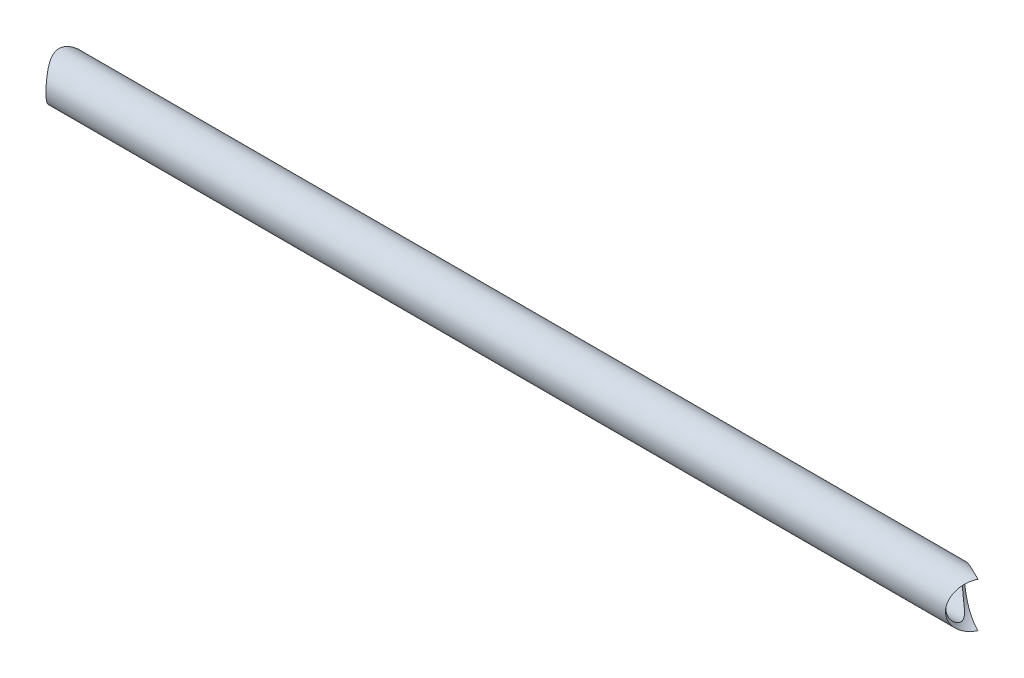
ISO-10303-21;
HEADER;
FILE_DESCRIPTION(('STEP AP214'),'2;1');
FILE_NAME('part.step','',(''),(''),'','','');
FILE_SCHEMA(('AUTOMOTIVE_DESIGN { 1 0 10303 214 1 1 1 1 }'));
ENDSEC;
DATA;
#1=APPLICATION_CONTEXT('core data for automotive mechanical design processes');
#2=APPLICATION_PROTOCOL_DEFINITION('international standard','automotive_design',2000,#1);
#3=PRODUCT_CONTEXT('',#1,'mechanical');
#4=PRODUCT('Part','Part','',(#3));
#5=PRODUCT_RELATED_PRODUCT_CATEGORY('part','',(#4));
#6=PRODUCT_DEFINITION_FORMATION('','',#4);
#7=PRODUCT_DEFINITION_CONTEXT('part definition',#1,'design');
#8=PRODUCT_DEFINITION('design','',#6,#7);
#9=PRODUCT_DEFINITION_SHAPE('','',#8);
#10=(LENGTH_UNIT() NAMED_UNIT(*) SI_UNIT(.MILLI.,.METRE.));
#11=(NAMED_UNIT(*) PLANE_ANGLE_UNIT() SI_UNIT($,.RADIAN.));
#12=(NAMED_UNIT(*) SI_UNIT($,.STERADIAN.) SOLID_ANGLE_UNIT());
#13=UNCERTAINTY_MEASURE_WITH_UNIT(LENGTH_MEASURE(1.E-05),#10,'distance_accuracy_value','');
#14=(GEOMETRIC_REPRESENTATION_CONTEXT(3) GLOBAL_UNCERTAINTY_ASSIGNED_CONTEXT((#13)) GLOBAL_UNIT_ASSIGNED_CONTEXT((#10,
#11,#12)) REPRESENTATION_CONTEXT('',''));
#15=CARTESIAN_POINT('',(0.,0.,0.));
#16=DIRECTION('',(0.,0.,1.));
#17=DIRECTION('',(1.,0.,0.));
#18=AXIS2_PLACEMENT_3D('',#15,#16,#17);
#19=CARTESIAN_POINT('',(-207.001,0.,-885.));
#20=DIRECTION('',(1.,0.,0.));
#21=DIRECTION('',(0.,0.,-1.));
#22=AXIS2_PLACEMENT_3D('',#19,#20,#21);
#23=CYLINDRICAL_SURFACE('',#22,9.99999999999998);
#24=CARTESIAN_POINT('',(-179.,0.,-895.));
#25=CARTESIAN_POINT('',(-178.999999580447,-0.247464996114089,-895.000000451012));
#26=CARTESIAN_POINT('',(-179.006574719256,-0.494924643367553,-894.990801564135));
#27=CARTESIAN_POINT('',(-179.032710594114,-0.987787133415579,-894.954161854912));
#28=CARTESIAN_POINT('',(-179.052270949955,-1.2331900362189,-894.926721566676));
#29=CARTESIAN_POINT('',(-179.103911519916,-1.72008364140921,-894.854031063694));
#30=CARTESIAN_POINT('',(-179.135996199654,-1.9615729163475,-894.808774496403));
#31=CARTESIAN_POINT('',(-179.211938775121,-2.4388020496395,-894.701138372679));
#32=CARTESIAN_POINT('',(-179.255796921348,-2.6745417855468,-894.63875845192));
#33=CARTESIAN_POINT('',(-179.354062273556,-3.13753083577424,-894.498112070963));
#34=CARTESIAN_POINT('',(-179.408412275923,-3.36481856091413,-894.41993165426));
#35=CARTESIAN_POINT('',(-179.526733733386,-3.81109103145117,-894.24839236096));
#36=CARTESIAN_POINT('',(-179.590708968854,-4.03007247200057,-894.155027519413));
#37=CARTESIAN_POINT('',(-179.727043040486,-4.4586048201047,-893.95415130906));
#38=CARTESIAN_POINT('',(-179.799398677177,-4.66815928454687,-893.846645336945));
#39=CARTESIAN_POINT('',(-179.951288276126,-5.07727885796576,-893.618360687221));
#40=CARTESIAN_POINT('',(-180.030824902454,-5.27684021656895,-893.497577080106));
#41=CARTESIAN_POINT('',(-180.203148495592,-5.68273222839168,-893.232282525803));
#42=CARTESIAN_POINT('',(-180.296484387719,-5.8880739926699,-893.086615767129));
#43=CARTESIAN_POINT('',(-180.488452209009,-6.285691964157,-892.781573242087));
#44=CARTESIAN_POINT('',(-180.587084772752,-6.47796659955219,-892.622195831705));
#45=CARTESIAN_POINT('',(-180.788073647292,-6.84934285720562,-892.290309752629));
#46=CARTESIAN_POINT('',(-180.890435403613,-7.02842395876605,-892.117781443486));
#47=CARTESIAN_POINT('',(-181.09691785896,-7.37271476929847,-891.760518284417));
#48=CARTESIAN_POINT('',(-181.201038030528,-7.53792855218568,-891.575787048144));
#49=CARTESIAN_POINT('',(-181.428375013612,-7.88338375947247,-891.159408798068));
#50=CARTESIAN_POINT('',(-181.551576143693,-8.06078638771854,-890.925388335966));
#51=CARTESIAN_POINT('',(-181.794456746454,-8.39514792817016,-890.44132736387));
#52=CARTESIAN_POINT('',(-181.91413525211,-8.55210126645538,-890.191282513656));
#53=CARTESIAN_POINT('',(-182.145897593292,-8.84438807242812,-889.675943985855));
#54=CARTESIAN_POINT('',(-182.257990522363,-8.97974770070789,-889.410669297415));
#55=CARTESIAN_POINT('',(-182.470214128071,-9.2276882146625,-888.865155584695));
#56=CARTESIAN_POINT('',(-182.570351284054,-9.34028146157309,-888.584924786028));
#57=CARTESIAN_POINT('',(-182.724163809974,-9.50871797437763,-888.102732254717));
#58=CARTESIAN_POINT('',(-182.78243404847,-9.57117527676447,-887.904527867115));
#59=CARTESIAN_POINT('',(-182.88942833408,-9.6841310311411,-887.502243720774));
#60=CARTESIAN_POINT('',(-182.938155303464,-9.73463314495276,-887.298165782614));
#61=CARTESIAN_POINT('',(-183.024343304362,-9.82293669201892,-886.885309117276));
#62=CARTESIAN_POINT('',(-183.061824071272,-9.86076038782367,-886.676539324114));
#63=CARTESIAN_POINT('',(-183.124171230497,-9.92320326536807,-886.255146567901));
#64=CARTESIAN_POINT('',(-183.149037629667,-9.94782245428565,-886.042523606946));
#65=CARTESIAN_POINT('',(-183.185190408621,-9.98349494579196,-885.613552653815));
#66=CARTESIAN_POINT('',(-183.196386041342,-9.99445760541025,-885.39718933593));
#67=CARTESIAN_POINT('',(-183.204368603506,-10.0022816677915,-884.963945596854));
#68=CARTESIAN_POINT('',(-183.201155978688,-9.99914350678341,-884.747065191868));
#69=CARTESIAN_POINT('',(-183.180468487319,-9.97882789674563,-884.314500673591));
#70=CARTESIAN_POINT('',(-183.162983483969,-9.96164046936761,-884.098817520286));
#71=CARTESIAN_POINT('',(-183.114545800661,-9.91357396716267,-883.670520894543));
#72=CARTESIAN_POINT('',(-183.083591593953,-9.88269334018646,-883.457907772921));
#73=CARTESIAN_POINT('',(-183.004780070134,-9.80301467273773,-883.01028804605));
#74=CARTESIAN_POINT('',(-182.9552687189,-9.75243183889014,-882.775889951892));
#75=CARTESIAN_POINT('',(-182.843103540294,-9.63556023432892,-882.314347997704));
#76=CARTESIAN_POINT('',(-182.780447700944,-9.56926905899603,-882.087205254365));
#77=CARTESIAN_POINT('',(-182.576234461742,-9.34800688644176,-881.417255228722));
#78=CARTESIAN_POINT('',(-182.418539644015,-9.17074973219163,-880.986482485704));
#79=CARTESIAN_POINT('',(-182.137640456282,-8.83399319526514,-880.304091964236));
#80=CARTESIAN_POINT('',(-182.021271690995,-8.68941642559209,-880.041883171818));
#81=CARTESIAN_POINT('',(-181.782391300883,-8.37875932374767,-879.53327263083));
#82=CARTESIAN_POINT('',(-181.659877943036,-8.21267290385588,-879.286875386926));
#83=CARTESIAN_POINT('',(-181.412495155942,-7.85978567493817,-878.810348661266));
#84=CARTESIAN_POINT('',(-181.287623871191,-7.67296793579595,-878.580232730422));
#85=CARTESIAN_POINT('',(-181.03901291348,-7.27935208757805,-878.137142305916));
#86=CARTESIAN_POINT('',(-180.915273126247,-7.07255602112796,-877.92416606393));
#87=CARTESIAN_POINT('',(-180.670820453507,-6.63733746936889,-877.514280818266));
#88=CARTESIAN_POINT('',(-180.55015007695,-6.40871982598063,-877.317553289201));
#89=CARTESIAN_POINT('',(-180.316182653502,-5.93221893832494,-876.943919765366));
#90=CARTESIAN_POINT('',(-180.202886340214,-5.68433378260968,-876.767015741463));
#91=CARTESIAN_POINT('',(-179.986876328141,-5.17069497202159,-876.435116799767));
#92=CARTESIAN_POINT('',(-179.884142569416,-4.90497683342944,-876.280080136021));
#93=CARTESIAN_POINT('',(-179.691944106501,-4.35659996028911,-875.993578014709));
#94=CARTESIAN_POINT('',(-179.602474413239,-4.07394765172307,-875.862103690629));
#95=CARTESIAN_POINT('',(-179.460401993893,-3.56786322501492,-875.6552253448));
#96=CARTESIAN_POINT('',(-179.404221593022,-3.34776380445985,-875.574079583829));
#97=CARTESIAN_POINT('',(-179.301797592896,-2.9003248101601,-875.426936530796));
#98=CARTESIAN_POINT('',(-179.255551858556,-2.6729868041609,-875.360935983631));
#99=CARTESIAN_POINT('',(-179.173950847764,-2.21246906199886,-875.244932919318));
#100=CARTESIAN_POINT('',(-179.138589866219,-1.97929245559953,-875.194922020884));
#101=CARTESIAN_POINT('',(-179.079487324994,-1.5085098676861,-875.111545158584));
#102=CARTESIAN_POINT('',(-179.055746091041,-1.27090376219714,-875.078179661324));
#103=CARTESIAN_POINT('',(-179.020367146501,-0.792236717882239,-875.028518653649));
#104=CARTESIAN_POINT('',(-179.008768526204,-0.551167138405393,-875.012278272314));
#105=CARTESIAN_POINT('',(-178.998082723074,-0.0682059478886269,-874.997314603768));
#106=CARTESIAN_POINT('',(-178.998995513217,0.173685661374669,-874.998591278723));
#107=CARTESIAN_POINT('',(-179.013311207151,0.656389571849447,-875.018641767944));
#108=CARTESIAN_POINT('',(-179.026715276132,0.897201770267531,-875.037417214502));
#109=CARTESIAN_POINT('',(-179.065701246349,1.37585442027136,-875.092172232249));
#110=CARTESIAN_POINT('',(-179.091282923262,1.61369492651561,-875.128151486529));
#111=CARTESIAN_POINT('',(-179.152535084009,2.07337564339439,-875.214645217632));
#112=CARTESIAN_POINT('',(-179.187662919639,2.29543618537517,-875.264379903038));
#113=CARTESIAN_POINT('',(-179.267753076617,2.7340659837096,-875.378344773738));
#114=CARTESIAN_POINT('',(-179.312718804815,2.95063330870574,-875.442579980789));
#115=CARTESIAN_POINT('',(-179.411636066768,3.37701892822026,-875.584786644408));
#116=CARTESIAN_POINT('',(-179.465585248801,3.58683897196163,-875.662754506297));
#117=CARTESIAN_POINT('',(-179.581570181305,3.99894837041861,-875.83168334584));
#118=CARTESIAN_POINT('',(-179.64360888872,4.20123493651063,-875.922649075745));
#119=CARTESIAN_POINT('',(-179.780700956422,4.61539980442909,-876.125544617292));
#120=CARTESIAN_POINT('',(-179.856423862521,4.82649190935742,-876.238626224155));
#121=CARTESIAN_POINT('',(-180.014986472,5.23813933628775,-876.478341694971));
#122=CARTESIAN_POINT('',(-180.097829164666,5.43869017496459,-876.604981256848));
#123=CARTESIAN_POINT('',(-180.269275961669,5.82872747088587,-876.870936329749));
#124=CARTESIAN_POINT('',(-180.357882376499,6.01820943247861,-877.010256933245));
#125=CARTESIAN_POINT('',(-180.539445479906,6.38565493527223,-877.300761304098));
#126=CARTESIAN_POINT('',(-180.632402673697,6.56361713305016,-877.451946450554));
#127=CARTESIAN_POINT('',(-180.838347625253,6.93887026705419,-877.793914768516));
#128=CARTESIAN_POINT('',(-180.9519155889,7.13382963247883,-877.986912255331));
#129=CARTESIAN_POINT('',(-181.180730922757,7.50684786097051,-878.387723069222));
#130=CARTESIAN_POINT('',(-181.295978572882,7.68490386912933,-878.595538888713));
#131=CARTESIAN_POINT('',(-181.525608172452,8.02372939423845,-879.02549342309));
#132=CARTESIAN_POINT('',(-181.639989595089,8.18448907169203,-879.247640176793));
#133=CARTESIAN_POINT('',(-181.864938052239,8.48799484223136,-879.70571869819));
#134=CARTESIAN_POINT('',(-181.975505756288,8.63074410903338,-879.94164802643));
#135=CARTESIAN_POINT('',(-182.172970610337,8.87672895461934,-880.38931715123));
#136=CARTESIAN_POINT('',(-182.260878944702,8.98265899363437,-880.599131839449));
#137=CARTESIAN_POINT('',(-182.429443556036,9.18042568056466,-881.028153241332));
#138=CARTESIAN_POINT('',(-182.510099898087,9.27226245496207,-881.247359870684));
#139=CARTESIAN_POINT('',(-182.661567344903,9.44084938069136,-881.694350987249));
#140=CARTESIAN_POINT('',(-182.732395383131,9.51762557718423,-881.922119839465));
#141=CARTESIAN_POINT('',(-182.861735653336,9.65528530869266,-882.385825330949));
#142=CARTESIAN_POINT('',(-182.920250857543,9.71617268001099,-882.621759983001));
#143=CARTESIAN_POINT('',(-183.012853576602,9.81124108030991,-883.055950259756));
#144=CARTESIAN_POINT('',(-183.049460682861,9.84828369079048,-883.253043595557));
#145=CARTESIAN_POINT('',(-183.111532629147,9.91060832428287,-883.650799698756));
#146=CARTESIAN_POINT('',(-183.136999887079,9.93589289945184,-883.851461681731));
#147=CARTESIAN_POINT('',(-183.175803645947,9.97426268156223,-884.254942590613));
#148=CARTESIAN_POINT('',(-183.189151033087,9.98735883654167,-884.457759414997));
#149=CARTESIAN_POINT('',(-183.203206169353,10.0011464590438,-884.864261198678));
#150=CARTESIAN_POINT('',(-183.203913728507,10.0018377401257,-885.067946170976));
#151=CARTESIAN_POINT('',(-183.192658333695,9.99080123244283,-885.474628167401));
#152=CARTESIAN_POINT('',(-183.180695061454,9.97907313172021,-885.677625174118));
#153=CARTESIAN_POINT('',(-183.14459284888,9.94341928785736,-886.081435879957));
#154=CARTESIAN_POINT('',(-183.120453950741,9.9194935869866,-886.282249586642));
#155=CARTESIAN_POINT('',(-183.060901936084,9.85982251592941,-886.680629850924));
#156=CARTESIAN_POINT('',(-183.025476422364,9.82406414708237,-886.878192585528));
#157=CARTESIAN_POINT('',(-182.944580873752,9.74124687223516,-887.268927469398));
#158=CARTESIAN_POINT('',(-182.899105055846,9.69418145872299,-887.462097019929));
#159=CARTESIAN_POINT('',(-182.782645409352,9.57157397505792,-887.90773875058));
#160=CARTESIAN_POINT('',(-182.708237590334,9.49178525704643,-888.158154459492));
#161=CARTESIAN_POINT('',(-182.547333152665,9.31429500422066,-888.64855878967));
#162=CARTESIAN_POINT('',(-182.460831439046,9.21658591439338,-888.888542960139));
#163=CARTESIAN_POINT('',(-182.278855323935,9.0042560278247,-889.357724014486));
#164=CARTESIAN_POINT('',(-182.18336997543,8.88961449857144,-889.58690721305));
#165=CARTESIAN_POINT('',(-181.986410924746,8.6443962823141,-890.033823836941));
#166=CARTESIAN_POINT('',(-181.884937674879,8.5138207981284,-890.251558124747));
#167=CARTESIAN_POINT('',(-181.675769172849,8.23366093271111,-890.681049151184));
#168=CARTESIAN_POINT('',(-181.567980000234,8.08366007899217,-890.892488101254));
#169=CARTESIAN_POINT('',(-181.351221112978,7.76805032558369,-891.302727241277));
#170=CARTESIAN_POINT('',(-181.24225138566,7.60244125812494,-891.501527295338));
#171=CARTESIAN_POINT('',(-181.025322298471,7.25595506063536,-891.886081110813));
#172=CARTESIAN_POINT('',(-180.917363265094,7.07507317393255,-892.071830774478));
#173=CARTESIAN_POINT('',(-180.704561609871,6.69843230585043,-892.429567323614));
#174=CARTESIAN_POINT('',(-180.599719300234,6.50267184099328,-892.601552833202));
#175=CARTESIAN_POINT('',(-180.37758306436,6.06180651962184,-892.959163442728));
#176=CARTESIAN_POINT('',(-180.261238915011,5.81399805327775,-893.142066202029));
#177=CARTESIAN_POINT('',(-180.038671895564,5.29930099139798,-893.486060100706));
#178=CARTESIAN_POINT('',(-179.932450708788,5.03240923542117,-893.647147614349));
#179=CARTESIAN_POINT('',(-179.733334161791,4.48121855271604,-893.945205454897));
#180=CARTESIAN_POINT('',(-179.640421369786,4.1969431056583,-894.082207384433));
#181=CARTESIAN_POINT('',(-179.470722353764,3.61262847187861,-894.330032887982));
#182=CARTESIAN_POINT('',(-179.393929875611,3.31259545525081,-894.440866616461));
#183=CARTESIAN_POINT('',(-179.273894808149,2.76662161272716,-894.612953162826));
#184=CARTESIAN_POINT('',(-179.22698783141,2.52321883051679,-894.679748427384));
#185=CARTESIAN_POINT('',(-179.145717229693,2.03008484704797,-894.79504106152));
#186=CARTESIAN_POINT('',(-179.111350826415,1.78035506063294,-894.843542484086));
#187=CARTESIAN_POINT('',(-179.056030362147,1.27665821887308,-894.92144347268));
#188=CARTESIAN_POINT('',(-179.035065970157,1.02269458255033,-894.950857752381));
#189=CARTESIAN_POINT('',(-179.007051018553,0.512485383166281,-894.990135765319));
#190=CARTESIAN_POINT('',(-179.000000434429,0.256239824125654,-894.999999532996));
#191=CARTESIAN_POINT('',(-179.,0.,-895.));
#192=B_SPLINE_CURVE_WITH_KNOTS('',3,(#24,#25,#26,#27,#28,#29,#30,#31,#32,#33,#34,#35,#36,#37,
#38,#39,#40,#41,#42,#43,#44,#45,#46,#47,#48,#49,#50,#51,#52,#53,#54,#55,#56,#57,#58,#59,#60,#61,
#62,#63,#64,#65,#66,#67,#68,#69,#70,#71,#72,#73,#74,#75,#76,#77,#78,#79,#80,#81,#82,#83,#84,#85,
#86,#87,#88,#89,#90,#91,#92,#93,#94,#95,#96,#97,#98,#99,#100,#101,#102,#103,#104,#105,#106,#107,
#108,#109,#110,#111,#112,#113,#114,#115,#116,#117,#118,#119,#120,#121,#122,#123,#124,#125,#126,
#127,#128,#129,#130,#131,#132,#133,#134,#135,#136,#137,#138,#139,#140,#141,#142,#143,#144,#145,
#146,#147,#148,#149,#150,#151,#152,#153,#154,#155,#156,#157,#158,#159,#160,#161,#162,#163,#164,
#165,#166,#167,#168,#169,#170,#171,#172,#173,#174,#175,#176,#177,#178,#179,#180,#181,#182,#183,
#184,#185,#186,#187,#188,#189,#190,#191),.UNSPECIFIED.,.T.,.F.,(4,2,2,2,2,2,2,2,2,2,2,2,2,2,2,2,
2,2,2,2,2,2,2,2,2,2,2,2,2,2,2,2,2,2,2,2,2,2,2,2,2,2,2,2,2,2,2,2,2,2,2,2,2,2,2,2,2,2,2,2,2,2,2,2,
2,2,2,2,2,2,2,2,2,2,2,2,2,2,2,2,2,2,2,4),(0.,0.742130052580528,1.48423837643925,
2.22661154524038,2.96900051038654,3.70745066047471,4.44619160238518,5.18465143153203,
5.92338635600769,6.72814112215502,7.53299251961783,8.33907042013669,9.14491067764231,
10.0992085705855,11.0537660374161,12.0071581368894,12.9600311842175,13.6069714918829,
14.2537133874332,14.8993136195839,15.5449135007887,16.1947760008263,16.8446183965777,
17.4949227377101,18.1453008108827,18.8787528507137,19.6123172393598,21.0811525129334,
22.0439284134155,23.0069773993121,23.9708187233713,24.9345616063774,25.907918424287,
26.881371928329,27.8529411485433,28.8241439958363,29.5470696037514,30.2698396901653,
30.9922302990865,31.7146411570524,32.4393705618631,33.1640984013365,33.8888938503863,
34.6136759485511,35.3037005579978,35.9939645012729,36.6840480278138,37.374384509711,
38.127131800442,38.8801966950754,39.6335653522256,40.3870217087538,41.2768512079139,
42.1668307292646,43.057313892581,43.9476399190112,44.6998511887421,45.4520557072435,
46.2029476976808,46.9536582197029,47.5646138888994,48.1754368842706,48.7857106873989,
49.3959936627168,50.0062919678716,50.6165881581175,51.2275570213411,51.8388783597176,
52.657102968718,53.4756733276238,54.2952544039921,55.1147736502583,55.9563119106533,
56.7978592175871,57.6396695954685,58.4815640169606,59.4678999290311,60.4543995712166,
61.4395950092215,62.4244075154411,63.1936180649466,63.9626580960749,64.7311045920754,
65.4995497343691),.UNSPECIFIED.);
#193=CARTESIAN_POINT('',(-179.,0.,-895.));
#194=VERTEX_POINT('',#193);
#195=EDGE_CURVE('E11',#194,#194,#192,.T.);
#196=ORIENTED_EDGE('',*,*,#195,.F.);
#197=EDGE_LOOP('',(#196));
#198=FACE_BOUND('',#197,.T.);
#199=CARTESIAN_POINT('',(229.336875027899,-10.,-885.));
#200=CARTESIAN_POINT('',(229.3301498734,-9.99999999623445,-885.003304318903));
#201=CARTESIAN_POINT('',(229.323425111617,-9.99999835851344,-885.00660949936));
#202=CARTESIAN_POINT('',(228.559423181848,-9.99962632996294,-885.382231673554));
#203=CARTESIAN_POINT('',(227.807141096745,-9.97850013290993,-885.765461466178));
#204=CARTESIAN_POINT('',(226.688419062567,-9.90979647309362,-886.354627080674));
#205=CARTESIAN_POINT('',(226.316982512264,-9.88070721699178,-886.553484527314));
#206=CARTESIAN_POINT('',(225.577795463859,-9.80905257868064,-886.955555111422));
#207=CARTESIAN_POINT('',(225.210044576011,-9.76648863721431,-887.158767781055));
#208=CARTESIAN_POINT('',(224.478404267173,-9.66662237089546,-887.569254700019));
#209=CARTESIAN_POINT('',(224.114518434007,-9.60930741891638,-887.776532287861));
#210=CARTESIAN_POINT('',(223.391553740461,-9.4785949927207,-888.194395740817));
#211=CARTESIAN_POINT('',(223.032474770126,-9.40519788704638,-888.404981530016));
#212=CARTESIAN_POINT('',(222.320228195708,-9.24087399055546,-888.828551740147));
#213=CARTESIAN_POINT('',(221.967055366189,-9.14996369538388,-889.041533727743));
#214=CARTESIAN_POINT('',(221.267213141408,-8.94884659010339,-889.469228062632));
#215=CARTESIAN_POINT('',(220.920544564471,-8.83863736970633,-889.683940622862));
#216=CARTESIAN_POINT('',(220.220182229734,-8.59177119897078,-890.12324919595));
#217=CARTESIAN_POINT('',(219.866832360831,-8.45417708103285,-890.347871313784));
#218=CARTESIAN_POINT('',(219.170581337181,-8.15344627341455,-890.796043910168));
#219=CARTESIAN_POINT('',(218.827676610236,-7.99031843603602,-891.019594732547));
#220=CARTESIAN_POINT('',(218.155692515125,-7.63620695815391,-891.46286114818));
#221=CARTESIAN_POINT('',(217.826573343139,-7.4453118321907,-891.682586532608));
#222=CARTESIAN_POINT('',(217.184508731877,-7.03228137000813,-892.115938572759));
#223=CARTESIAN_POINT('',(216.871552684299,-6.81016688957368,-892.329569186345));
#224=CARTESIAN_POINT('',(216.289255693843,-6.34956427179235,-892.731044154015));
#225=CARTESIAN_POINT('',(216.018409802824,-6.11362988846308,-892.91961075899));
#226=CARTESIAN_POINT('',(215.498905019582,-5.60953130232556,-893.284323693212));
#227=CARTESIAN_POINT('',(215.250250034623,-5.34136144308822,-893.460467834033));
#228=CARTESIAN_POINT('',(214.776350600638,-4.76426357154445,-893.79862791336));
#229=CARTESIAN_POINT('',(214.551732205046,-4.45457657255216,-893.96025371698));
#230=CARTESIAN_POINT('',(214.244000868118,-3.96286838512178,-894.183033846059));
#231=CARTESIAN_POINT('',(214.146247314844,-3.79434295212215,-894.25404872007));
#232=CARTESIAN_POINT('',(213.961791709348,-3.44846239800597,-894.388423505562));
#233=CARTESIAN_POINT('',(213.875084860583,-3.27111115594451,-894.451786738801));
#234=CARTESIAN_POINT('',(213.713141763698,-2.90593777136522,-894.57041269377));
#235=CARTESIAN_POINT('',(213.638048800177,-2.71801871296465,-894.62557394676));
#236=CARTESIAN_POINT('',(213.502025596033,-2.33457377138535,-894.725687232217));
#237=CARTESIAN_POINT('',(213.441087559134,-2.13905214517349,-894.770644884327));
#238=CARTESIAN_POINT('',(213.334737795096,-1.74179076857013,-894.8492189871));
#239=CARTESIAN_POINT('',(213.289310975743,-1.54005727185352,-894.882846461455));
#240=CARTESIAN_POINT('',(213.215056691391,-1.13191644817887,-894.937863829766));
#241=CARTESIAN_POINT('',(213.186226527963,-0.925509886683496,-894.959255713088));
#242=CARTESIAN_POINT('',(213.148215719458,-0.533487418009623,-894.987470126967));
#243=CARTESIAN_POINT('',(213.137188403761,-0.348146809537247,-894.995661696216));
#244=CARTESIAN_POINT('',(213.129065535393,0.0230026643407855,-895.001695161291));
#245=CARTESIAN_POINT('',(213.131968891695,0.208811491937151,-894.999537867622));
#246=CARTESIAN_POINT('',(213.151640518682,0.579281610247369,-894.984928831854));
#247=CARTESIAN_POINT('',(213.168409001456,0.763942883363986,-894.972476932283));
#248=CARTESIAN_POINT('',(213.215433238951,1.13057285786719,-894.937591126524));
#249=CARTESIAN_POINT('',(213.245688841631,1.31254158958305,-894.915157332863));
#250=CARTESIAN_POINT('',(213.315801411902,1.65649836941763,-894.863241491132));
#251=CARTESIAN_POINT('',(213.354572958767,1.81883052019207,-894.834557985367));
#252=CARTESIAN_POINT('',(213.442158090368,2.139290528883,-894.769861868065));
#253=CARTESIAN_POINT('',(213.490975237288,2.29741687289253,-894.733846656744));
#254=CARTESIAN_POINT('',(213.651442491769,2.76434221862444,-894.615678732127));
#255=CARTESIAN_POINT('',(213.777153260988,3.06590103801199,-894.523370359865));
#256=CARTESIAN_POINT('',(214.022715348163,3.56961005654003,-894.343964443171));
#257=CARTESIAN_POINT('',(214.135496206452,3.77712818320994,-894.261821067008));
#258=CARTESIAN_POINT('',(214.375783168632,4.17909630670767,-894.08752474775));
#259=CARTESIAN_POINT('',(214.503295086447,4.37354109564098,-893.995367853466));
#260=CARTESIAN_POINT('',(214.905170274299,4.93762103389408,-893.706247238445));
#261=CARTESIAN_POINT('',(215.198604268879,5.28747125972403,-893.496831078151));
#262=CARTESIAN_POINT('',(215.74927292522,5.86081114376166,-893.108109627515));
#263=CARTESIAN_POINT('',(215.999043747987,6.09476142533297,-892.933136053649));
#264=CARTESIAN_POINT('',(216.515933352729,6.53538620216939,-892.574261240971));
#265=CARTESIAN_POINT('',(216.783061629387,6.74204557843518,-892.390355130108));
#266=CARTESIAN_POINT('',(217.33150101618,7.13044689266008,-892.016377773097));
#267=CARTESIAN_POINT('',(217.612835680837,7.31214545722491,-891.826296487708));
#268=CARTESIAN_POINT('',(218.186662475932,7.65243610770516,-891.442512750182));
#269=CARTESIAN_POINT('',(218.479153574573,7.81103032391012,-891.248810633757));
#270=CARTESIAN_POINT('',(219.032948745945,8.0870374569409,-890.885955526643));
#271=CARTESIAN_POINT('',(219.293092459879,8.2071179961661,-890.71704184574));
#272=CARTESIAN_POINT('',(219.819280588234,8.43276621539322,-890.378644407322));
#273=CARTESIAN_POINT('',(220.085325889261,8.53833169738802,-890.20916056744));
#274=CARTESIAN_POINT('',(220.622613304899,8.73607008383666,-889.870276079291));
#275=CARTESIAN_POINT('',(220.893858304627,8.82823529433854,-889.70087553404));
#276=CARTESIAN_POINT('',(221.440754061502,9.00009020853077,-889.362832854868));
#277=CARTESIAN_POINT('',(221.716405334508,9.07977843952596,-889.194190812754));
#278=CARTESIAN_POINT('',(222.549345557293,9.3015420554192,-888.690030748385));
#279=CARTESIAN_POINT('',(223.11245107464,9.4262552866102,-888.356386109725));
#280=CARTESIAN_POINT('',(224.250342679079,9.63551947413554,-887.697434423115));
#281=CARTESIAN_POINT('',(224.825124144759,9.72008600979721,-887.372124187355));
#282=CARTESIAN_POINT('',(225.945018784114,9.84977248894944,-886.753543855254));
#283=CARTESIAN_POINT('',(226.489499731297,9.89717907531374,-886.459597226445));
#284=CARTESIAN_POINT('',(227.584853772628,9.96523259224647,-885.882325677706));
#285=CARTESIAN_POINT('',(228.135718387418,9.98591165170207,-885.598988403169));
#286=CARTESIAN_POINT('',(228.898177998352,9.99819887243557,-885.216703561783));
#287=CARTESIAN_POINT('',(229.107236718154,9.9998929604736,-885.112898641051));
#288=CARTESIAN_POINT('',(229.32342508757,9.99999836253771,-885.006609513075));
#289=CARTESIAN_POINT('',(229.330149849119,10.0000000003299,-885.003304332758));
#290=CARTESIAN_POINT('',(229.336875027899,10.,-885.));
#291=B_SPLINE_CURVE_WITH_KNOTS('',3,(#199,#200,#201,#202,#203,#204,#205,#206,#207,#208,#209,
#210,#211,#212,#213,#214,#215,#216,#217,#218,#219,#220,#221,#222,#223,#224,#225,#226,#227,#228,
#229,#230,#231,#232,#233,#234,#235,#236,#237,#238,#239,#240,#241,#242,#243,#244,#245,#246,#247,
#248,#249,#250,#251,#252,#253,#254,#255,#256,#257,#258,#259,#260,#261,#262,#263,#264,#265,#266,
#267,#268,#269,#270,#271,#272,#273,#274,#275,#276,#277,#278,#279,#280,#281,#282,#283,#284,#285,
#286,#287,#288,#289,#290),.UNSPECIFIED.,.F.,.F.,(4,2,2,2,2,2,2,2,2,2,2,2,2,2,2,2,2,2,2,2,2,2,2,
2,2,2,2,2,2,2,2,2,2,2,2,2,2,2,2,2,2,2,2,2,2,4),(0.,0.0224793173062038,2.55403066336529,
3.82081618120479,5.08746629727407,6.35520431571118,7.62291328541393,8.88943398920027,
10.156112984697,11.4775351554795,12.7985002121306,14.115343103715,15.4313104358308,
16.6465723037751,17.8620477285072,19.1039329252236,19.7255112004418,20.3468186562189,
20.9752667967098,21.6033679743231,22.23085626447,22.8582425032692,23.4150009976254,
23.9717158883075,24.5284392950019,25.0851564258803,25.5926513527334,26.1003265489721,
27.1150215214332,27.8642666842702,28.6138085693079,30.1147488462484,31.2664475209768,
32.4187815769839,33.5730933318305,34.7272985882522,35.7247259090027,36.7223041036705,
37.7204528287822,38.7187192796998,40.7158804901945,42.7122660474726,44.5732322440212,
46.4319593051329,47.1321924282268,47.1546717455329),.UNSPECIFIED.);
#292=CARTESIAN_POINT('',(229.336875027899,10.,-885.));
#293=VERTEX_POINT('',#292);
#294=CARTESIAN_POINT('',(229.336875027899,-10.,-885.));
#295=VERTEX_POINT('',#294);
#296=EDGE_CURVE('E53',#293,#295,#291,.F.);
#297=ORIENTED_EDGE('',*,*,#296,.T.);
#298=CARTESIAN_POINT('',(229.336875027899,-10.,-885.));
#299=CARTESIAN_POINT('',(229.333570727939,-10.0000000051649,-884.993274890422));
#300=CARTESIAN_POINT('',(229.330266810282,-9.99999322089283,-884.98654950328));
#301=CARTESIAN_POINT('',(229.179318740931,-9.99937294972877,-884.679234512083));
#302=CARTESIAN_POINT('',(229.032449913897,-9.98520251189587,-884.378117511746));
#303=CARTESIAN_POINT('',(228.741243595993,-9.92952727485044,-883.777014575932));
#304=CARTESIAN_POINT('',(228.596907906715,-9.88800377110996,-883.477029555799));
#305=CARTESIAN_POINT('',(228.311368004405,-9.77735800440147,-882.879682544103));
#306=CARTESIAN_POINT('',(228.170172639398,-9.70816617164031,-882.582329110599));
#307=CARTESIAN_POINT('',(227.89222434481,-9.54219098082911,-881.993304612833));
#308=CARTESIAN_POINT('',(227.755471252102,-9.44540863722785,-881.701633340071));
#309=CARTESIAN_POINT('',(227.487028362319,-9.22415441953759,-881.125681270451));
#310=CARTESIAN_POINT('',(227.355350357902,-9.0996221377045,-880.841418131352));
#311=CARTESIAN_POINT('',(227.098314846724,-8.82331120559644,-880.283422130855));
#312=CARTESIAN_POINT('',(226.972957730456,-8.67153087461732,-880.009689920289));
#313=CARTESIAN_POINT('',(226.729639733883,-8.34143033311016,-879.475598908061));
#314=CARTESIAN_POINT('',(226.611672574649,-8.16313309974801,-879.215228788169));
#315=CARTESIAN_POINT('',(226.383995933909,-7.7807408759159,-878.710298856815));
#316=CARTESIAN_POINT('',(226.274285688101,-7.57664827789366,-878.465737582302));
#317=CARTESIAN_POINT('',(226.071222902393,-7.15850358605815,-878.011105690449));
#318=CARTESIAN_POINT('',(225.977265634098,-6.94606483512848,-877.799820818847));
#319=CARTESIAN_POINT('',(225.798154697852,-6.50100327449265,-877.395573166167));
#320=CARTESIAN_POINT('',(225.713000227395,-6.26838230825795,-877.20260871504));
#321=CARTESIAN_POINT('',(225.552279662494,-5.78455633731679,-876.837232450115));
#322=CARTESIAN_POINT('',(225.476710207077,-5.53335789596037,-876.664813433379));
#323=CARTESIAN_POINT('',(225.335853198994,-5.01415982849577,-876.34254492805));
#324=CARTESIAN_POINT('',(225.270564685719,-4.74616177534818,-876.192693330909));
#325=CARTESIAN_POINT('',(225.156487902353,-4.22111633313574,-875.930261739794));
#326=CARTESIAN_POINT('',(225.106730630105,-3.96536097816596,-875.815513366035));
#327=CARTESIAN_POINT('',(225.016664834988,-3.44368252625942,-875.607455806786));
#328=CARTESIAN_POINT('',(224.976355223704,-3.17776060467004,-875.514144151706));
#329=CARTESIAN_POINT('',(224.905567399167,-2.63788370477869,-875.350070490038));
#330=CARTESIAN_POINT('',(224.875085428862,-2.36393184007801,-875.279299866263));
#331=CARTESIAN_POINT('',(224.824224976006,-1.8101147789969,-875.161115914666));
#332=CARTESIAN_POINT('',(224.803846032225,-1.53024985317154,-875.113701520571));
#333=CARTESIAN_POINT('',(224.77443953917,-0.986364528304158,-875.045254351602));
#334=CARTESIAN_POINT('',(224.764726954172,-0.72258013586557,-875.022629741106));
#335=CARTESIAN_POINT('',(224.754316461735,-0.193878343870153,-874.998378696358));
#336=CARTESIAN_POINT('',(224.753618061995,0.0710389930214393,-874.996751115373));
#337=CARTESIAN_POINT('',(224.761240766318,0.599991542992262,-875.014509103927));
#338=CARTESIAN_POINT('',(224.769560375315,0.864026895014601,-875.033891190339));
#339=CARTESIAN_POINT('',(224.795144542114,1.38930296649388,-875.093451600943));
#340=CARTESIAN_POINT('',(224.812409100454,1.65054368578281,-875.133629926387));
#341=CARTESIAN_POINT('',(224.855251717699,2.16254977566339,-875.233225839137));
#342=CARTESIAN_POINT('',(224.880636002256,2.41341886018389,-875.292194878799));
#343=CARTESIAN_POINT('',(224.939609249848,2.90896074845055,-875.429001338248));
#344=CARTESIAN_POINT('',(224.973198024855,3.1536336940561,-875.506838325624));
#345=CARTESIAN_POINT('',(225.048320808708,3.6352081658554,-875.680622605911));
#346=CARTESIAN_POINT('',(225.089855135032,3.87210938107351,-875.776570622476));
#347=CARTESIAN_POINT('',(225.180557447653,4.33667462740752,-875.98567005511));
#348=CARTESIAN_POINT('',(225.229725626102,4.56433842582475,-876.098821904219));
#349=CARTESIAN_POINT('',(225.336755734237,5.01505692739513,-876.344548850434));
#350=CARTESIAN_POINT('',(225.394814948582,5.23782567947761,-876.477562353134));
#351=CARTESIAN_POINT('',(225.518191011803,5.6709705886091,-876.759437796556));
#352=CARTESIAN_POINT('',(225.583507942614,5.88134660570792,-876.908299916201));
#353=CARTESIAN_POINT('',(225.720958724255,6.28862699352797,-877.220602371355));
#354=CARTESIAN_POINT('',(225.793092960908,6.48553060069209,-877.384043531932));
#355=CARTESIAN_POINT('',(225.94371637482,6.86494033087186,-877.724182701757));
#356=CARTESIAN_POINT('',(226.022206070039,7.04744527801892,-877.900881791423));
#357=CARTESIAN_POINT('',(226.190352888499,7.40863787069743,-878.278049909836));
#358=CARTESIAN_POINT('',(226.280404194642,7.58630860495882,-878.479317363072));
#359=CARTESIAN_POINT('',(226.466595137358,7.92369068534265,-878.893730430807));
#360=CARTESIAN_POINT('',(226.56273503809,8.08340125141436,-879.106876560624));
#361=CARTESIAN_POINT('',(226.760582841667,8.38437477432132,-879.543570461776));
#362=CARTESIAN_POINT('',(226.86229408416,8.52562649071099,-879.767124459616));
#363=CARTESIAN_POINT('',(227.07066049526,8.78914870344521,-880.222952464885));
#364=CARTESIAN_POINT('',(227.177316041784,8.91141774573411,-880.45522713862));
#365=CARTESIAN_POINT('',(227.404421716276,9.14641685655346,-880.94738255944));
#366=CARTESIAN_POINT('',(227.525266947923,9.2574062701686,-881.207913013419));
#367=CARTESIAN_POINT('',(227.771355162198,9.45633861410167,-881.735476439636));
#368=CARTESIAN_POINT('',(227.896596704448,9.54428901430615,-882.002507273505));
#369=CARTESIAN_POINT('',(228.150680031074,9.69700932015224,-882.541080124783));
#370=CARTESIAN_POINT('',(228.27951815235,9.76180194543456,-882.812617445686));
#371=CARTESIAN_POINT('',(228.540172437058,9.86829715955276,-883.358647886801));
#372=CARTESIAN_POINT('',(228.671987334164,9.91000938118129,-883.633139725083));
#373=CARTESIAN_POINT('',(228.891131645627,9.95981950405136,-884.086649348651));
#374=CARTESIAN_POINT('',(228.977799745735,9.97458025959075,-884.265288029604));
#375=CARTESIAN_POINT('',(229.151872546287,9.99447680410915,-884.622614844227));
#376=CARTESIAN_POINT('',(229.239276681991,9.99961939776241,-884.801302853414));
#377=CARTESIAN_POINT('',(229.330266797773,9.99999321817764,-884.986549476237));
#378=CARTESIAN_POINT('',(229.333570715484,10.0000000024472,-884.993274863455));
#379=CARTESIAN_POINT('',(229.336875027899,10.,-885.));
#380=B_SPLINE_CURVE_WITH_KNOTS('',3,(#298,#299,#300,#301,#302,#303,#304,#305,#306,#307,#308,
#309,#310,#311,#312,#313,#314,#315,#316,#317,#318,#319,#320,#321,#322,#323,#324,#325,#326,#327,
#328,#329,#330,#331,#332,#333,#334,#335,#336,#337,#338,#339,#340,#341,#342,#343,#344,#345,#346,
#347,#348,#349,#350,#351,#352,#353,#354,#355,#356,#357,#358,#359,#360,#361,#362,#363,#364,#365,
#366,#367,#368,#369,#370,#371,#372,#373,#374,#375,#376,#377,#378,#379),.UNSPECIFIED.,.F.,.F.,(4,
2,2,2,2,2,2,2,2,2,2,2,2,2,2,2,2,2,2,2,2,2,2,2,2,2,2,2,2,2,2,2,2,2,2,2,2,2,2,2,4),(0.,
0.0224793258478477,1.02714718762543,2.03250277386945,3.04040230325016,4.0482647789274,
5.05834304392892,6.06848363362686,7.07775397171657,8.08693077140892,9.02768784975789,
9.96835908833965,10.9086995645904,11.8489521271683,12.7019419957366,13.5548335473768,
14.4073986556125,15.2599248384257,16.0537451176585,16.8475220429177,17.6411673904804,
18.4348127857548,19.2107775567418,19.9867245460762,20.7627025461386,21.5387000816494,
22.3354439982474,23.1321969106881,23.9289949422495,24.725857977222,25.5744506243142,
26.4230801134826,27.2722239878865,28.1214328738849,29.0441173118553,29.9665022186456,
30.8879796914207,31.8090722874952,32.4061728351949,33.0028507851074,33.0253301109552),.UNSPECIFIED.);
#381=EDGE_CURVE('E51',#295,#293,#380,.T.);
#382=ORIENTED_EDGE('',*,*,#381,.T.);
#383=EDGE_LOOP('',(#297,#382));
#384=FACE_BOUND('',#383,.T.);
#385=ADVANCED_FACE('F34',(#198,#384),#23,.T.);
#386=CARTESIAN_POINT('',(-207.001,0.,-885.));
#387=DIRECTION('',(1.,0.,0.));
#388=DIRECTION('',(0.,0.,-1.));
#389=AXIS2_PLACEMENT_3D('',#386,#387,#388);
#390=CYLINDRICAL_SURFACE('',#389,8.49999999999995);
#391=CARTESIAN_POINT('',(-179.,0.,-893.5));
#392=CARTESIAN_POINT('',(-179.000001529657,-0.217092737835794,-893.499998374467));
#393=CARTESIAN_POINT('',(-179.005061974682,-0.434228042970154,-893.491670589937));
#394=CARTESIAN_POINT('',(-179.025183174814,-0.866853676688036,-893.458467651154));
#395=CARTESIAN_POINT('',(-179.040249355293,-1.08234304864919,-893.433583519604));
#396=CARTESIAN_POINT('',(-179.080044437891,-1.51033548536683,-893.367547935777));
#397=CARTESIAN_POINT('',(-179.104791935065,-1.72283198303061,-893.32636517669));
#398=CARTESIAN_POINT('',(-179.163346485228,-2.14289606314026,-893.228276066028));
#399=CARTESIAN_POINT('',(-179.19715440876,-2.35046316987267,-893.171368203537));
#400=CARTESIAN_POINT('',(-179.272846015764,-2.75826704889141,-893.042850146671));
#401=CARTESIAN_POINT('',(-179.314687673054,-2.95853578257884,-892.971316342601));
#402=CARTESIAN_POINT('',(-179.405640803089,-3.35173533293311,-892.814135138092));
#403=CARTESIAN_POINT('',(-179.454752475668,-3.54466594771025,-892.728487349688));
#404=CARTESIAN_POINT('',(-179.559209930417,-3.92217910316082,-892.54391341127));
#405=CARTESIAN_POINT('',(-179.614552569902,-4.10676578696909,-892.44499395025));
#406=CARTESIAN_POINT('',(-179.730411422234,-4.46697642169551,-892.234615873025));
#407=CARTESIAN_POINT('',(-179.79092941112,-4.64259726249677,-892.123152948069));
#408=CARTESIAN_POINT('',(-179.98821300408,-5.18136949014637,-891.752968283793));
#409=CARTESIAN_POINT('',(-180.132436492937,-5.52726323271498,-891.472641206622));
#410=CARTESIAN_POINT('',(-180.427996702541,-6.17010576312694,-890.863142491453));
#411=CARTESIAN_POINT('',(-180.579342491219,-6.46698986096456,-890.533907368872));
#412=CARTESIAN_POINT('',(-180.811058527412,-6.88911607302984,-889.985209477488));
#413=CARTESIAN_POINT('',(-180.893578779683,-7.03272169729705,-889.780545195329));
#414=CARTESIAN_POINT('',(-181.054126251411,-7.30209977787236,-889.35799370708));
#415=CARTESIAN_POINT('',(-181.132152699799,-7.42786917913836,-889.140104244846));
#416=CARTESIAN_POINT('',(-181.280832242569,-7.66029574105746,-888.692346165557));
#417=CARTESIAN_POINT('',(-181.351495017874,-7.76697813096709,-888.462493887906));
#418=CARTESIAN_POINT('',(-181.482654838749,-7.96017632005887,-887.991699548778));
#419=CARTESIAN_POINT('',(-181.543155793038,-8.0466998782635,-887.750761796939));
#420=CARTESIAN_POINT('',(-181.637789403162,-8.17955249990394,-887.320011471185));
#421=CARTESIAN_POINT('',(-181.674745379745,-8.23053193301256,-887.132242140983));
#422=CARTESIAN_POINT('',(-181.740098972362,-8.31971713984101,-886.752246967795));
#423=CARTESIAN_POINT('',(-181.768498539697,-8.35792582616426,-886.560022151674));
#424=CARTESIAN_POINT('',(-181.815739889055,-8.42103818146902,-886.172443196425));
#425=CARTESIAN_POINT('',(-181.834591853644,-8.44595602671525,-885.977092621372));
#426=CARTESIAN_POINT('',(-181.862083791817,-8.48217803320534,-885.584405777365));
#427=CARTESIAN_POINT('',(-181.870723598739,-8.49348197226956,-885.387069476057));
#428=CARTESIAN_POINT('',(-181.877460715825,-8.50230276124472,-884.991482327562));
#429=CARTESIAN_POINT('',(-181.875535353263,-8.49978996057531,-884.793230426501));
#430=CARTESIAN_POINT('',(-181.861165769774,-8.48094980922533,-884.397772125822));
#431=CARTESIAN_POINT('',(-181.848721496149,-8.4646223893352,-884.200565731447));
#432=CARTESIAN_POINT('',(-181.813783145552,-8.4183957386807,-883.808530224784));
#433=CARTESIAN_POINT('',(-181.7912824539,-8.38848757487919,-883.613702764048));
#434=CARTESIAN_POINT('',(-181.737050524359,-8.31552934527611,-883.227845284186));
#435=CARTESIAN_POINT('',(-181.705319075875,-8.27247897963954,-883.036815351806));
#436=CARTESIAN_POINT('',(-181.634256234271,-8.17456191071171,-882.662620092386));
#437=CARTESIAN_POINT('',(-181.595053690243,-8.11989395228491,-882.479378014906));
#438=CARTESIAN_POINT('',(-181.509874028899,-7.99890455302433,-882.11836923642));
#439=CARTESIAN_POINT('',(-181.463894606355,-7.93257914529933,-881.94060442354));
#440=CARTESIAN_POINT('',(-181.317602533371,-7.71697912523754,-881.416585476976));
#441=CARTESIAN_POINT('',(-181.208898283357,-7.55103079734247,-881.079418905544));
#442=CARTESIAN_POINT('',(-180.958000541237,-7.14538851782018,-880.375423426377));
#443=CARTESIAN_POINT('',(-180.813291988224,-6.89782063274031,-880.014029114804));
#444=CARTESIAN_POINT('',(-180.593214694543,-6.48813380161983,-879.504390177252));
#445=CARTESIAN_POINT('',(-180.51929431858,-6.34505569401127,-879.339803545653));
#446=CARTESIAN_POINT('',(-180.371953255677,-6.04649592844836,-879.021921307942));
#447=CARTESIAN_POINT('',(-180.298532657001,-5.89101213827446,-878.86862765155));
#448=CARTESIAN_POINT('',(-180.143096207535,-5.5444738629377,-878.552394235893));
#449=CARTESIAN_POINT('',(-180.061400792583,-5.35154830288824,-878.391341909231));
#450=CARTESIAN_POINT('',(-179.902894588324,-4.95097978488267,-878.086161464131));
#451=CARTESIAN_POINT('',(-179.826081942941,-4.74334248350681,-877.942026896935));
#452=CARTESIAN_POINT('',(-179.67939853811,-4.3142750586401,-877.671883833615));
#453=CARTESIAN_POINT('',(-179.609527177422,-4.09284613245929,-877.545873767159));
#454=CARTESIAN_POINT('',(-179.478718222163,-3.63744909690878,-877.313368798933));
#455=CARTESIAN_POINT('',(-179.417779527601,-3.4034825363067,-877.20687149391));
#456=CARTESIAN_POINT('',(-179.310059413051,-2.93918677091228,-877.020659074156));
#457=CARTESIAN_POINT('',(-179.262642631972,-2.7095008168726,-876.939709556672));
#458=CARTESIAN_POINT('',(-179.178676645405,-2.24217736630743,-876.797422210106));
#459=CARTESIAN_POINT('',(-179.142127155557,-2.00454007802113,-876.736083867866));
#460=CARTESIAN_POINT('',(-179.081044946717,-1.52360844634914,-876.634058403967));
#461=CARTESIAN_POINT('',(-179.056499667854,-1.28032029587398,-876.593349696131));
#462=CARTESIAN_POINT('',(-179.020159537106,-0.790196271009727,-876.533210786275));
#463=CARTESIAN_POINT('',(-179.008362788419,-0.543360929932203,-876.513777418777));
#464=CARTESIAN_POINT('',(-178.998628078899,-0.0832327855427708,-876.497739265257));
#465=CARTESIAN_POINT('',(-178.998985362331,0.129932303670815,-876.498326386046));
#466=CARTESIAN_POINT('',(-179.00940252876,0.555378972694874,-876.515492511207));
#467=CARTESIAN_POINT('',(-179.019462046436,0.767660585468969,-876.532070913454));
#468=CARTESIAN_POINT('',(-179.049037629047,1.18970745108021,-876.580990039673));
#469=CARTESIAN_POINT('',(-179.068552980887,1.39947289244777,-876.61332957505));
#470=CARTESIAN_POINT('',(-179.116574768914,1.81500711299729,-876.693344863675));
#471=CARTESIAN_POINT('',(-179.145081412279,2.02077579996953,-876.741020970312));
#472=CARTESIAN_POINT('',(-179.209496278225,2.42114489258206,-876.849549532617));
#473=CARTESIAN_POINT('',(-179.245169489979,2.61589639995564,-876.909986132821));
#474=CARTESIAN_POINT('',(-179.323659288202,2.9993369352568,-877.044168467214));
#475=CARTESIAN_POINT('',(-179.366478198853,3.18802396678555,-877.117918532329));
#476=CARTESIAN_POINT('',(-179.458408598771,3.55832485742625,-877.278018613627));
#477=CARTESIAN_POINT('',(-179.507518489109,3.73994049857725,-877.364365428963));
#478=CARTESIAN_POINT('',(-179.611132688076,4.09543348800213,-877.548987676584));
#479=CARTESIAN_POINT('',(-179.665638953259,4.26930799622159,-877.647267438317));
#480=CARTESIAN_POINT('',(-179.847501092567,4.81322316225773,-877.980364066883));
#481=CARTESIAN_POINT('',(-179.983524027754,5.16727957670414,-878.237051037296));
#482=CARTESIAN_POINT('',(-180.266477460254,5.82988266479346,-878.799059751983));
#483=CARTESIAN_POINT('',(-180.413420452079,6.13837596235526,-879.104437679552));
#484=CARTESIAN_POINT('',(-180.642861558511,6.58285897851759,-879.617034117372));
#485=CARTESIAN_POINT('',(-180.72576564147,6.73578124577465,-879.809637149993));
#486=CARTESIAN_POINT('',(-180.888918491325,7.02490078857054,-880.208197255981));
#487=CARTESIAN_POINT('',(-180.969166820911,7.1610953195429,-880.414156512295));
#488=CARTESIAN_POINT('',(-181.124411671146,7.41570167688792,-880.838444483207));
#489=CARTESIAN_POINT('',(-181.199412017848,7.5341265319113,-881.05676397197));
#490=CARTESIAN_POINT('',(-181.341532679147,7.75223092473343,-881.50500534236));
#491=CARTESIAN_POINT('',(-181.408655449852,7.85191631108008,-881.734923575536));
#492=CARTESIAN_POINT('',(-181.518953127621,8.01204597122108,-882.154624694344));
#493=CARTESIAN_POINT('',(-181.564174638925,8.0763195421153,-882.342415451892));
#494=CARTESIAN_POINT('',(-181.646688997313,8.19190911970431,-882.723546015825));
#495=CARTESIAN_POINT('',(-181.683986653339,8.243232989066,-882.916882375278));
#496=CARTESIAN_POINT('',(-181.749410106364,8.33230374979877,-883.307990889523));
#497=CARTESIAN_POINT('',(-181.777544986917,8.37006409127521,-883.505758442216));
#498=CARTESIAN_POINT('',(-181.823660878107,8.43154360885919,-883.904651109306));
#499=CARTESIAN_POINT('',(-181.841641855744,8.45526273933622,-884.105776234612));
#500=CARTESIAN_POINT('',(-181.866791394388,8.48835115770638,-884.510768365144));
#501=CARTESIAN_POINT('',(-181.873912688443,8.49765771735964,-884.714643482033));
#502=CARTESIAN_POINT('',(-181.876896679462,8.501563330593,-885.122618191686));
#503=CARTESIAN_POINT('',(-181.872759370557,8.49616237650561,-885.326717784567));
#504=CARTESIAN_POINT('',(-181.853395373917,8.47074121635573,-885.733556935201));
#505=CARTESIAN_POINT('',(-181.838163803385,8.45071457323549,-885.93629585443));
#506=CARTESIAN_POINT('',(-181.797223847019,8.39636572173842,-886.338761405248));
#507=CARTESIAN_POINT('',(-181.771515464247,8.36204351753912,-886.538488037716));
#508=CARTESIAN_POINT('',(-181.712343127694,8.28197600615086,-886.92225570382));
#509=CARTESIAN_POINT('',(-181.679407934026,8.23699787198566,-887.106539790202));
#510=CARTESIAN_POINT('',(-181.606104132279,8.13529695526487,-887.470354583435));
#511=CARTESIAN_POINT('',(-181.565733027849,8.07857022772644,-887.64988367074));
#512=CARTESIAN_POINT('',(-181.435142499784,7.89159243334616,-888.180117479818));
#513=CARTESIAN_POINT('',(-181.335414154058,7.74450277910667,-888.522661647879));
#514=CARTESIAN_POINT('',(-181.103447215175,7.38406614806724,-889.231666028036));
#515=CARTESIAN_POINT('',(-180.968571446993,7.16404894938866,-889.593856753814));
#516=CARTESIAN_POINT('',(-180.760011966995,6.79724975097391,-890.108013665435));
#517=CARTESIAN_POINT('',(-180.689400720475,6.66875393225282,-890.274648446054));
#518=CARTESIAN_POINT('',(-180.547503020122,6.39987505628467,-890.597836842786));
#519=CARTESIAN_POINT('',(-180.476216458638,6.25949007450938,-890.754388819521));
#520=CARTESIAN_POINT('',(-180.322079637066,5.9419408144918,-891.083111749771));
#521=CARTESIAN_POINT('',(-180.239371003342,5.76262308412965,-891.253274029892));
#522=CARTESIAN_POINT('',(-180.077174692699,5.38906625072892,-891.577931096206));
#523=CARTESIAN_POINT('',(-179.997686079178,5.19483153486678,-891.73243045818));
#524=CARTESIAN_POINT('',(-179.843905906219,4.79204436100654,-892.024833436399));
#525=CARTESIAN_POINT('',(-179.769618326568,4.5834811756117,-892.162724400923));
#526=CARTESIAN_POINT('',(-179.628301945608,4.15318604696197,-892.420507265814));
#527=CARTESIAN_POINT('',(-179.561272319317,3.93145560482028,-892.540401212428));
#528=CARTESIAN_POINT('',(-179.437724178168,3.4810903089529,-892.758428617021));
#529=CARTESIAN_POINT('',(-179.381007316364,3.25271366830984,-892.856981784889));
#530=CARTESIAN_POINT('',(-179.277959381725,2.78615195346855,-893.034276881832));
#531=CARTESIAN_POINT('',(-179.231626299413,2.5479687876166,-893.113022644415));
#532=CARTESIAN_POINT('',(-179.150885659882,2.06444434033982,-893.249301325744));
#533=CARTESIAN_POINT('',(-179.116441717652,1.81912743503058,-893.306899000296));
#534=CARTESIAN_POINT('',(-179.060426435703,1.32305880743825,-893.400185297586));
#535=CARTESIAN_POINT('',(-179.03884471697,1.07231163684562,-893.435891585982));
#536=CARTESIAN_POINT('',(-179.016054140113,0.684033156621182,-893.473537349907));
#537=CARTESIAN_POINT('',(-179.010040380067,0.547498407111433,-893.483454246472));
#538=CARTESIAN_POINT('',(-179.002012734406,0.273981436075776,-893.49668623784));
#539=CARTESIAN_POINT('',(-178.99999903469,0.136999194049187,-893.500001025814));
#540=CARTESIAN_POINT('',(-179.,0.,-893.5));
#541=B_SPLINE_CURVE_WITH_KNOTS('',3,(#391,#392,#393,#394,#395,#396,#397,#398,#399,#400,#401,
#402,#403,#404,#405,#406,#407,#408,#409,#410,#411,#412,#413,#414,#415,#416,#417,#418,#419,#420,
#421,#422,#423,#424,#425,#426,#427,#428,#429,#430,#431,#432,#433,#434,#435,#436,#437,#438,#439,
#440,#441,#442,#443,#444,#445,#446,#447,#448,#449,#450,#451,#452,#453,#454,#455,#456,#457,#458,
#459,#460,#461,#462,#463,#464,#465,#466,#467,#468,#469,#470,#471,#472,#473,#474,#475,#476,#477,
#478,#479,#480,#481,#482,#483,#484,#485,#486,#487,#488,#489,#490,#491,#492,#493,#494,#495,#496,
#497,#498,#499,#500,#501,#502,#503,#504,#505,#506,#507,#508,#509,#510,#511,#512,#513,#514,#515,
#516,#517,#518,#519,#520,#521,#522,#523,#524,#525,#526,#527,#528,#529,#530,#531,#532,#533,#534,
#535,#536,#537,#538,#539,#540),.UNSPECIFIED.,.T.,.F.,(4,2,2,2,2,2,2,2,2,2,2,2,2,2,2,2,2,2,2,2,2,
2,2,2,2,2,2,2,2,2,2,2,2,2,2,2,2,2,2,2,2,2,2,2,2,2,2,2,2,2,2,2,2,2,2,2,2,2,2,2,2,2,2,2,2,2,2,2,2,
2,2,2,2,2,4),(0.,0.651135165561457,1.30262368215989,1.95536971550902,2.60817848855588,
3.25766100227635,3.9071613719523,4.55633561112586,5.20573353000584,6.60391244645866,
8.00392237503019,8.79295242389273,9.58211745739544,10.3702315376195,11.1580417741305,
11.75159066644,12.3450040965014,12.9377833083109,13.5305721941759,14.1246336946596,
14.7186981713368,15.3131539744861,15.9076233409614,16.4926414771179,17.0778590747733,
18.2477057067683,19.62619494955,20.3165178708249,21.0069596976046,21.7987577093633,
22.5902529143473,23.3816795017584,24.1730085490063,24.9162403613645,25.659452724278,
26.4018857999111,27.1442083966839,27.7829051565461,28.4215778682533,29.0602024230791,
29.6988416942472,30.3192152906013,30.9397910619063,31.5602094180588,32.1808535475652,
33.5490794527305,34.9188957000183,35.6967075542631,36.4746468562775,37.2520129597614,
38.0291360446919,38.6392669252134,39.2490264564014,39.858179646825,40.4673348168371,
41.0791338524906,41.6909332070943,42.3030019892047,42.9150705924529,43.4920700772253,
44.0692636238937,45.2230575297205,46.552092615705,47.2175212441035,47.8830577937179,
48.6641680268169,49.4450494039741,50.2265219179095,51.007905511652,51.7721456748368,
52.5362378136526,53.2979703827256,54.0590874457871,54.4699756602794,54.8808829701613),.UNSPECIFIED.);
#542=CARTESIAN_POINT('',(-179.,0.,-893.5));
#543=VERTEX_POINT('',#542);
#544=EDGE_CURVE('E46',#543,#543,#541,.T.);
#545=ORIENTED_EDGE('',*,*,#544,.T.);
#546=EDGE_LOOP('',(#545));
#547=FACE_BOUND('',#546,.T.);
#548=CARTESIAN_POINT('',(215.030301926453,-4.26669903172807,-892.351549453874));
#549=CARTESIAN_POINT('',(215.221586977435,-4.53271136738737,-892.197165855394));
#550=CARTESIAN_POINT('',(215.42580981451,-4.78343293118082,-892.032369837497));
#551=CARTESIAN_POINT('',(215.853780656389,-5.25578555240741,-891.686744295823));
#552=CARTESIAN_POINT('',(216.077556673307,-5.47737369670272,-891.505891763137));
#553=CARTESIAN_POINT('',(216.541206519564,-5.8948369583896,-891.130279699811));
#554=CARTESIAN_POINT('',(216.781191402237,-6.09050010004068,-890.935423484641));
#555=CARTESIAN_POINT('',(217.271510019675,-6.45619883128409,-890.535424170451));
#556=CARTESIAN_POINT('',(217.521839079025,-6.62624584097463,-890.330285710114));
#557=CARTESIAN_POINT('',(217.940965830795,-6.88756643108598,-889.984040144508));
#558=CARTESIAN_POINT('',(218.107752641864,-6.98563074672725,-889.845550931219));
#559=CARTESIAN_POINT('',(218.443483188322,-7.17224690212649,-889.564789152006));
#560=CARTESIAN_POINT('',(218.61242709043,-7.2607980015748,-889.422516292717));
#561=CARTESIAN_POINT('',(218.951760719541,-7.42883812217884,-889.134036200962));
#562=CARTESIAN_POINT('',(219.122151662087,-7.5083184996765,-888.987825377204));
#563=CARTESIAN_POINT('',(219.463335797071,-7.65840854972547,-888.69139272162));
#564=CARTESIAN_POINT('',(219.634128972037,-7.72901860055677,-888.541171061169));
#565=CARTESIAN_POINT('',(219.974444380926,-7.86126783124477,-888.23695326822));
#566=CARTESIAN_POINT('',(220.14396894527,-7.92294316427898,-888.082975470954));
#567=CARTESIAN_POINT('',(220.481371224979,-8.03770282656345,-887.77003909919));
#568=CARTESIAN_POINT('',(220.649248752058,-8.09078618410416,-887.611079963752));
#569=CARTESIAN_POINT('',(220.981754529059,-8.18812151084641,-887.28761009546));
#570=CARTESIAN_POINT('',(221.146386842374,-8.23238525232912,-887.123107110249));
#571=CARTESIAN_POINT('',(221.470875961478,-8.31174260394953,-886.787370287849));
#572=CARTESIAN_POINT('',(221.630734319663,-8.3468392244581,-886.616138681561));
#573=CARTESIAN_POINT('',(221.911300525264,-8.40091274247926,-886.301763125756));
#574=CARTESIAN_POINT('',(222.03329692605,-8.4217204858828,-886.160087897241));
#575=CARTESIAN_POINT('',(222.271472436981,-8.45650092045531,-885.871079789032));
#576=CARTESIAN_POINT('',(222.38765162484,-8.47047370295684,-885.723746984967));
#577=CARTESIAN_POINT('',(222.612217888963,-8.49078893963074,-885.423235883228));
#578=CARTESIAN_POINT('',(222.720622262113,-8.49714885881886,-885.27007180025));
#579=CARTESIAN_POINT('',(222.927940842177,-8.50133047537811,-884.957305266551));
#580=CARTESIAN_POINT('',(223.026856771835,-8.49915372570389,-884.797703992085));
#581=CARTESIAN_POINT('',(223.199231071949,-8.48620567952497,-884.496493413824));
#582=CARTESIAN_POINT('',(223.274286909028,-8.47676255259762,-884.35574423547));
#583=CARTESIAN_POINT('',(223.414803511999,-8.45021067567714,-884.070223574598));
#584=CARTESIAN_POINT('',(223.480265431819,-8.43310284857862,-883.925452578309));
#585=CARTESIAN_POINT('',(223.60063756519,-8.39063697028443,-883.632872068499));
#586=CARTESIAN_POINT('',(223.655555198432,-8.36528475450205,-883.485064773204));
#587=CARTESIAN_POINT('',(223.754449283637,-8.30590066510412,-883.187537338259));
#588=CARTESIAN_POINT('',(223.798425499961,-8.27186860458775,-883.037817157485));
#589=CARTESIAN_POINT('',(223.875523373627,-8.1949579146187,-882.738011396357));
#590=CARTESIAN_POINT('',(223.908654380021,-8.15208695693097,-882.587926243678));
#591=CARTESIAN_POINT('',(223.964771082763,-8.05749945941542,-882.288665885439));
#592=CARTESIAN_POINT('',(223.987756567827,-8.00578273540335,-882.139490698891));
#593=CARTESIAN_POINT('',(224.024661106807,-7.89359073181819,-881.843041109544));
#594=CARTESIAN_POINT('',(224.03856391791,-7.83309999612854,-881.695770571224));
#595=CARTESIAN_POINT('',(224.058498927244,-7.70371154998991,-881.404411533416));
#596=CARTESIAN_POINT('',(224.064529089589,-7.63481166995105,-881.260323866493));
#597=CARTESIAN_POINT('',(224.071002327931,-7.46299090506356,-880.925613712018));
#598=CARTESIAN_POINT('',(224.068695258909,-7.35668593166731,-880.736668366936));
#599=CARTESIAN_POINT('',(224.055086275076,-7.13011168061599,-880.367675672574));
#600=CARTESIAN_POINT('',(224.043781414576,-7.00983784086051,-880.187631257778));
#601=CARTESIAN_POINT('',(224.0148167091,-6.75609120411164,-879.837440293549));
#602=CARTESIAN_POINT('',(223.997151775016,-6.62260789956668,-879.667301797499));
#603=CARTESIAN_POINT('',(223.957674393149,-6.34335814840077,-879.337984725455));
#604=CARTESIAN_POINT('',(223.935862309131,-6.19759277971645,-879.178805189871));
#605=CARTESIAN_POINT('',(223.889464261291,-5.89178366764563,-878.869333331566));
#606=CARTESIAN_POINT('',(223.864834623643,-5.731526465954,-878.719258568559));
#607=CARTESIAN_POINT('',(223.814679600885,-5.39996932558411,-878.432013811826));
#608=CARTESIAN_POINT('',(223.789154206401,-5.22866927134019,-878.294843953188));
#609=CARTESIAN_POINT('',(223.738467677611,-4.87599592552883,-878.034174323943));
#610=CARTESIAN_POINT('',(223.713306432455,-4.69462578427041,-877.910670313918));
#611=CARTESIAN_POINT('',(223.664359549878,-4.32274476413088,-877.677979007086));
#612=CARTESIAN_POINT('',(223.64057393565,-4.13223373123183,-877.568791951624));
#613=CARTESIAN_POINT('',(223.593045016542,-3.72454329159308,-877.355681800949));
#614=CARTESIAN_POINT('',(223.569522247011,-3.50655364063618,-877.253254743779));
#615=CARTESIAN_POINT('',(223.526002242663,-3.06235352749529,-877.067157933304));
#616=CARTESIAN_POINT('',(223.506005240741,-2.83614252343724,-876.983489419));
#617=CARTESIAN_POINT('',(223.470212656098,-2.37708423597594,-876.835587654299));
#618=CARTESIAN_POINT('',(223.45441774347,-2.14423590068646,-876.771357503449));
#619=CARTESIAN_POINT('',(223.427536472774,-1.67366308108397,-876.662905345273));
#620=CARTESIAN_POINT('',(223.416449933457,-1.43593878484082,-876.618682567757));
#621=CARTESIAN_POINT('',(223.399533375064,-0.963331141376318,-876.551476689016));
#622=CARTESIAN_POINT('',(223.393580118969,-0.728522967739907,-876.527995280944));
#623=CARTESIAN_POINT('',(223.386639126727,-0.257694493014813,-876.500635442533));
#624=CARTESIAN_POINT('',(223.385651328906,-0.0216742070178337,-876.496756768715));
#625=CARTESIAN_POINT('',(223.388668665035,0.449810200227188,-876.50863527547));
#626=CARTESIAN_POINT('',(223.392673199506,0.685274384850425,-876.524390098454));
#627=CARTESIAN_POINT('',(223.405561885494,1.15394470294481,-876.57539472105));
#628=CARTESIAN_POINT('',(223.414446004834,1.38715085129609,-876.610644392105));
#629=CARTESIAN_POINT('',(223.436653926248,1.84578061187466,-876.699593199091));
#630=CARTESIAN_POINT('',(223.449901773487,2.07126914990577,-876.752977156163));
#631=CARTESIAN_POINT('',(223.480491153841,2.51687641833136,-876.877877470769));
#632=CARTESIAN_POINT('',(223.497832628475,2.73699522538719,-876.949393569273));
#633=CARTESIAN_POINT('',(223.536083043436,3.1703614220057,-877.109993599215));
#634=CARTESIAN_POINT('',(223.556991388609,3.38360995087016,-877.199074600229));
#635=CARTESIAN_POINT('',(223.601697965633,3.80190356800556,-877.394160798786));
#636=CARTESIAN_POINT('',(223.625496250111,4.00694850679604,-877.500166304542));
#637=CARTESIAN_POINT('',(223.675584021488,4.41125384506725,-877.730477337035));
#638=CARTESIAN_POINT('',(223.701911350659,4.61033788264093,-877.855084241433));
#639=CARTESIAN_POINT('',(223.755547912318,4.99743188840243,-878.120267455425));
#640=CARTESIAN_POINT('',(223.78285716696,5.18544160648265,-878.260844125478));
#641=CARTESIAN_POINT('',(223.837097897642,5.54952491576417,-878.557331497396));
#642=CARTESIAN_POINT('',(223.864028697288,5.72557887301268,-878.713266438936));
#643=CARTESIAN_POINT('',(223.91570875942,6.06432995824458,-879.039364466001));
#644=CARTESIAN_POINT('',(223.940458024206,6.22702710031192,-879.209527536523));
#645=CARTESIAN_POINT('',(223.986173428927,6.54213386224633,-879.567791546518));
#646=CARTESIAN_POINT('',(224.007022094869,6.6941571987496,-879.756248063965));
#647=CARTESIAN_POINT('',(224.041120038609,6.98191060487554,-880.145971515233));
#648=CARTESIAN_POINT('',(224.054367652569,7.11763710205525,-880.347241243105));
#649=CARTESIAN_POINT('',(224.069534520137,7.37117211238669,-880.760379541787));
#650=CARTESIAN_POINT('',(224.071488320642,7.48903419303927,-880.972213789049));
#651=CARTESIAN_POINT('',(224.05981559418,7.70604097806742,-881.404814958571));
#652=CARTESIAN_POINT('',(224.04620068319,7.80519957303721,-881.625575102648));
#653=CARTESIAN_POINT('',(224.007038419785,7.95302326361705,-881.995929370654));
#654=CARTESIAN_POINT('',(223.987201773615,8.00732840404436,-882.143900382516));
#655=CARTESIAN_POINT('',(223.937778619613,8.10720554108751,-882.441139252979));
#656=CARTESIAN_POINT('',(223.908195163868,8.15278026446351,-882.590406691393));
#657=CARTESIAN_POINT('',(223.838538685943,8.23506157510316,-882.888681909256));
#658=CARTESIAN_POINT('',(223.798482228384,8.27178199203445,-883.037689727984));
#659=CARTESIAN_POINT('',(223.707552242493,8.3365725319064,-883.334286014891));
#660=CARTESIAN_POINT('',(223.656678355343,8.36464236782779,-883.481874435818));
#661=CARTESIAN_POINT('',(223.544490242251,8.41242263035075,-883.774024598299));
#662=CARTESIAN_POINT('',(223.48319876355,8.43215095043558,-883.918592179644));
#663=CARTESIAN_POINT('',(223.350852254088,8.46386876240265,-884.204037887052));
#664=CARTESIAN_POINT('',(223.279797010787,8.47585808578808,-884.34491593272));
#665=CARTESIAN_POINT('',(223.128911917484,8.4927566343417,-884.622555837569));
#666=CARTESIAN_POINT('',(223.049070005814,8.4976559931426,-884.759311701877));
#667=CARTESIAN_POINT('',(222.88191916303,8.50101706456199,-885.028287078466));
#668=CARTESIAN_POINT('',(222.794607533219,8.49947644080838,-885.16050492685));
#669=CARTESIAN_POINT('',(222.541468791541,8.48704403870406,-885.524337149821));
#670=CARTESIAN_POINT('',(222.368680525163,8.46966051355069,-885.750901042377));
#671=CARTESIAN_POINT('',(222.009333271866,8.41906599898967,-886.190983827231));
#672=CARTESIAN_POINT('',(221.822761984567,8.38584072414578,-886.404490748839));
#673=CARTESIAN_POINT('',(221.439727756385,8.30524282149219,-886.82161076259));
#674=CARTESIAN_POINT('',(221.243218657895,8.25779793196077,-887.025166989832));
#675=CARTESIAN_POINT('',(220.844777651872,8.14989671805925,-887.42315362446));
#676=CARTESIAN_POINT('',(220.642847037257,8.08944347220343,-887.617586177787));
#677=CARTESIAN_POINT('',(220.271176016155,7.96745990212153,-887.966057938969));
#678=CARTESIAN_POINT('',(220.101887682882,7.9079120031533,-888.12128213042));
#679=CARTESIAN_POINT('',(219.762473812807,7.78019970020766,-888.427240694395));
#680=CARTESIAN_POINT('',(219.592348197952,7.71203447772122,-888.577974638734));
#681=CARTESIAN_POINT('',(219.25215398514,7.56690740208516,-888.875476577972));
#682=CARTESIAN_POINT('',(219.08208550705,7.48993952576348,-889.02224177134));
#683=CARTESIAN_POINT('',(218.742995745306,7.32697686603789,-889.311964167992));
#684=CARTESIAN_POINT('',(218.573974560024,7.24098124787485,-889.454921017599));
#685=CARTESIAN_POINT('',(218.238559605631,7.05999697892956,-889.73648922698));
#686=CARTESIAN_POINT('',(218.072157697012,6.96504831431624,-889.87511654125));
#687=CARTESIAN_POINT('',(217.74209129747,6.76541734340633,-890.14857104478));
#688=CARTESIAN_POINT('',(217.578426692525,6.66073544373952,-890.283398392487));
#689=CARTESIAN_POINT('',(217.254894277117,6.44125428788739,-890.548861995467));
#690=CARTESIAN_POINT('',(217.09502236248,6.32646666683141,-890.679502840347));
#691=CARTESIAN_POINT('',(216.779834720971,6.0861065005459,-890.936349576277));
#692=CARTESIAN_POINT('',(216.624519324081,5.96053317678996,-891.062555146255));
#693=CARTESIAN_POINT('',(216.323887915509,5.70175331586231,-891.306401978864));
#694=CARTESIAN_POINT('',(216.178413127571,5.56886566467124,-891.424184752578));
#695=CARTESIAN_POINT('',(215.893979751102,5.29183793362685,-891.65423706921));
#696=CARTESIAN_POINT('',(215.755020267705,5.1476994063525,-891.766507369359));
#697=CARTESIAN_POINT('',(215.48499915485,4.84770244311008,-891.984563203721));
#698=CARTESIAN_POINT('',(215.353933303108,4.69185037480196,-892.090352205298));
#699=CARTESIAN_POINT('',(215.101240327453,4.36805317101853,-892.294297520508));
#700=CARTESIAN_POINT('',(214.979612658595,4.20010873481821,-892.392454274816));
#701=CARTESIAN_POINT('',(214.669732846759,3.73491723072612,-892.642595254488));
#702=CARTESIAN_POINT('',(214.491373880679,3.42636102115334,-892.786635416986));
#703=CARTESIAN_POINT('',(214.255063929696,2.93906068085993,-892.977619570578));
#704=CARTESIAN_POINT('',(214.181508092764,2.77257854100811,-893.037093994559));
#705=CARTESIAN_POINT('',(214.046069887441,2.43189559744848,-893.146646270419));
#706=CARTESIAN_POINT('',(213.984185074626,2.25769641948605,-893.196726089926));
#707=CARTESIAN_POINT('',(213.8834809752,1.93471099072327,-893.278249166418));
#708=CARTESIAN_POINT('',(213.842514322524,1.78702712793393,-893.311424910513));
#709=CARTESIAN_POINT('',(213.770015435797,1.48788353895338,-893.370150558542));
#710=CARTESIAN_POINT('',(213.738481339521,1.33642456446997,-893.39570196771));
#711=CARTESIAN_POINT('',(213.685437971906,1.03069685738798,-893.43868950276));
#712=CARTESIAN_POINT('',(213.663923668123,0.876429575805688,-893.456129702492));
#713=CARTESIAN_POINT('',(213.63132264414,0.566069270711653,-893.48255965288));
#714=CARTESIAN_POINT('',(213.620236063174,0.40997622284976,-893.491549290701));
#715=CARTESIAN_POINT('',(213.608709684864,0.0967954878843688,-893.500895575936));
#716=CARTESIAN_POINT('',(213.608293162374,-0.0602936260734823,-893.501233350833));
#717=CARTESIAN_POINT('',(213.618174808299,-0.373910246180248,-893.493220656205));
#718=CARTESIAN_POINT('',(213.628473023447,-0.530437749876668,-893.484870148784));
#719=CARTESIAN_POINT('',(213.659574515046,-0.84180661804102,-893.459655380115));
#720=CARTESIAN_POINT('',(213.680381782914,-0.99664731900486,-893.442787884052));
#721=CARTESIAN_POINT('',(213.732084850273,-1.30349953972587,-893.400885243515));
#722=CARTESIAN_POINT('',(213.762980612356,-1.45551106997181,-893.375850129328));
#723=CARTESIAN_POINT('',(213.833427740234,-1.7521664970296,-893.318784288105));
#724=CARTESIAN_POINT('',(213.872752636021,-1.89689966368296,-893.286936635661));
#725=CARTESIAN_POINT('',(213.959828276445,-2.18213224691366,-893.216441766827));
#726=CARTESIAN_POINT('',(214.007582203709,-2.32263004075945,-893.177791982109));
#727=CARTESIAN_POINT('',(214.162430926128,-2.73680453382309,-893.052511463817));
#728=CARTESIAN_POINT('',(214.281177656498,-3.00342815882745,-892.956496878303));
#729=CARTESIAN_POINT('',(214.504345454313,-3.43782944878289,-892.776176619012));
#730=CARTESIAN_POINT('',(214.602335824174,-3.61122046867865,-892.69703279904));
#731=CARTESIAN_POINT('',(214.80882018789,-3.94707885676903,-892.530314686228));
#732=CARTESIAN_POINT('',(214.917303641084,-4.10955691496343,-892.442748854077));
#733=CARTESIAN_POINT('',(215.030301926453,-4.26669903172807,-892.351549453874));
#734=B_SPLINE_CURVE_WITH_KNOTS('',3,(#548,#549,#550,#551,#552,#553,#554,#555,#556,#557,#558,
#559,#560,#561,#562,#563,#564,#565,#566,#567,#568,#569,#570,#571,#572,#573,#574,#575,#576,#577,
#578,#579,#580,#581,#582,#583,#584,#585,#586,#587,#588,#589,#590,#591,#592,#593,#594,#595,#596,
#597,#598,#599,#600,#601,#602,#603,#604,#605,#606,#607,#608,#609,#610,#611,#612,#613,#614,#615,
#616,#617,#618,#619,#620,#621,#622,#623,#624,#625,#626,#627,#628,#629,#630,#631,#632,#633,#634,
#635,#636,#637,#638,#639,#640,#641,#642,#643,#644,#645,#646,#647,#648,#649,#650,#651,#652,#653,
#654,#655,#656,#657,#658,#659,#660,#661,#662,#663,#664,#665,#666,#667,#668,#669,#670,#671,#672,
#673,#674,#675,#676,#677,#678,#679,#680,#681,#682,#683,#684,#685,#686,#687,#688,#689,#690,#691,
#692,#693,#694,#695,#696,#697,#698,#699,#700,#701,#702,#703,#704,#705,#706,#707,#708,#709,#710,
#711,#712,#713,#714,#715,#716,#717,#718,#719,#720,#721,#722,#723,#724,#725,#726,#727,#728,#729,
#730,#731,#732,#733),.UNSPECIFIED.,.T.,.F.,(4,2,2,2,2,2,2,2,2,2,2,2,2,2,2,2,2,2,2,2,2,2,2,2,2,2,
2,2,2,2,2,2,2,2,2,2,2,2,2,2,2,2,2,2,2,2,2,2,2,2,2,2,2,2,2,2,2,2,2,2,2,2,2,2,2,2,2,2,2,2,2,2,2,2,
2,2,2,2,2,2,2,2,2,2,2,2,2,2,2,2,2,2,4),(0.,1.08620437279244,2.17399120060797,3.27018563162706,
4.36588990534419,5.07948753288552,5.79314065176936,6.50746824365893,7.22176536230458,
7.93308620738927,8.64448744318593,9.35493265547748,10.0651442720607,10.6292466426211,
11.1933414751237,11.7561396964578,12.3188355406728,12.7977349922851,13.2765767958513,
13.7550804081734,14.2335943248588,14.7116946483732,15.1898049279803,15.6687679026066,
16.1478547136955,16.7973462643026,17.4470505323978,18.0972758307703,18.7474441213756,
19.4095818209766,20.0717264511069,20.7336650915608,21.3956148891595,22.1207179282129,
22.8458688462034,23.5711353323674,24.2963738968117,25.0036736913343,25.7109647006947,
26.4181707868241,27.1253722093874,27.8208627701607,28.5163433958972,29.2117080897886,
29.9070854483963,30.6152841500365,31.3234988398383,32.0328497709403,32.7421999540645,
33.470325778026,34.1986109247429,34.924667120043,35.6501819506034,36.1262964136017,
36.602261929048,37.0774791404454,37.5527121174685,38.0269204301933,38.5011390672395,
38.976016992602,39.4510672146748,40.3059384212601,41.1615819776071,42.02164970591,
42.881514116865,43.5931394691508,44.3048324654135,45.0170153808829,45.7292642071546,
46.4384704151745,47.1476470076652,47.8560175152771,48.5644391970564,49.2527023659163,
49.9408707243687,50.6286676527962,51.3164248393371,52.4645000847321,53.038351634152,
53.6120828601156,54.0820421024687,54.5519085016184,55.0215386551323,55.4911750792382,
55.9618358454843,56.4324986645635,56.9033403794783,57.3741803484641,57.833676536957,
58.2933465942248,59.211858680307,59.8541534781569,60.4958096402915),.UNSPECIFIED.);
#735=CARTESIAN_POINT('',(215.030301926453,-4.26669903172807,-892.351549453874));
#736=VERTEX_POINT('',#735);
#737=EDGE_CURVE('E57',#736,#736,#734,.T.);
#738=ORIENTED_EDGE('',*,*,#737,.F.);
#739=EDGE_LOOP('',(#738));
#740=FACE_BOUND('',#739,.T.);
#741=ADVANCED_FACE('F83',(#547,#740),#390,.F.);
#742=CARTESIAN_POINT('',(-193.,0.,-531.999));
#743=DIRECTION('',(0.,0.,-1.));
#744=DIRECTION('',(-1.,0.,0.));
#745=AXIS2_PLACEMENT_3D('',#742,#743,#744);
#746=CYLINDRICAL_SURFACE('',#745,14.);
#747=ORIENTED_EDGE('',*,*,#195,.T.);
#748=EDGE_LOOP('',(#747));
#749=FACE_BOUND('',#748,.T.);
#750=ORIENTED_EDGE('',*,*,#544,.F.);
#751=EDGE_LOOP('',(#750));
#752=FACE_BOUND('',#751,.T.);
#753=ADVANCED_FACE('F36',(#749,#752),#746,.F.);
#754=CARTESIAN_POINT('',(261.,0.,-909.442719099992));
#755=DIRECTION('',(0.,1.,0.));
#756=DIRECTION('',(0.,0.,1.));
#757=AXIS2_PLACEMENT_3D('',#754,#755,#756);
#758=TOROIDAL_SURFACE('',#757,40.,10.);
#759=ORIENTED_EDGE('',*,*,#737,.T.);
#760=EDGE_LOOP('',(#759));
#761=FACE_BOUND('',#760,.T.);
#762=ORIENTED_EDGE('',*,*,#296,.F.);
#763=ORIENTED_EDGE('',*,*,#381,.F.);
#764=EDGE_LOOP('',(#762,#763));
#765=FACE_BOUND('',#764,.T.);
#766=ADVANCED_FACE('F54',(#761,#765),#758,.F.);
#767=CLOSED_SHELL('',(#385,#741,#753,#766));
#768=MANIFOLD_SOLID_BREP('B2',#767);
#769=ADVANCED_BREP_SHAPE_REPRESENTATION('',(#18,#768),#14);
#770=SHAPE_DEFINITION_REPRESENTATION(#9,#769);
ENDSEC;
END-ISO-10303-21;
